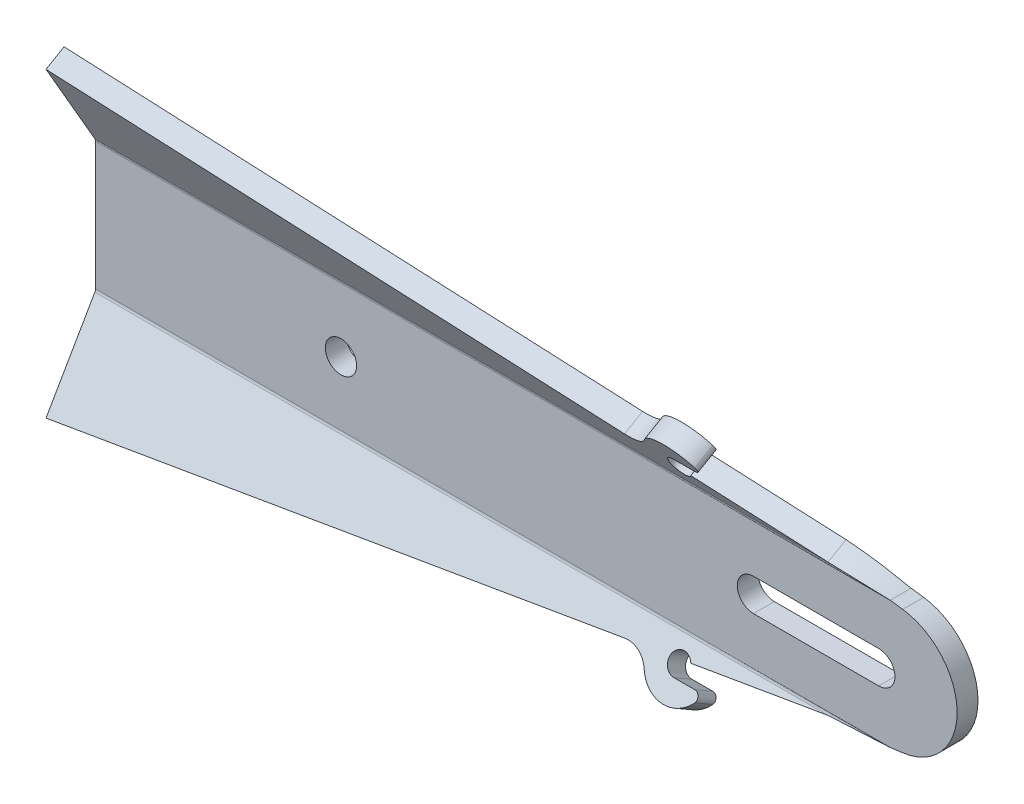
ISO-10303-21;
HEADER;
FILE_DESCRIPTION(('STEP AP214'),'2;1');
FILE_NAME('part.step','',(''),(''),'','','');
FILE_SCHEMA(('AUTOMOTIVE_DESIGN { 1 0 10303 214 1 1 1 1 }'));
ENDSEC;
DATA;
#1=APPLICATION_CONTEXT('core data for automotive mechanical design processes');
#2=APPLICATION_PROTOCOL_DEFINITION('international standard','automotive_design',2000,#1);
#3=PRODUCT_CONTEXT('',#1,'mechanical');
#4=PRODUCT('Part','Part','',(#3));
#5=PRODUCT_RELATED_PRODUCT_CATEGORY('part','',(#4));
#6=PRODUCT_DEFINITION_FORMATION('','',#4);
#7=PRODUCT_DEFINITION_CONTEXT('part definition',#1,'design');
#8=PRODUCT_DEFINITION('design','',#6,#7);
#9=PRODUCT_DEFINITION_SHAPE('','',#8);
#10=(LENGTH_UNIT() NAMED_UNIT(*) SI_UNIT(.MILLI.,.METRE.));
#11=(NAMED_UNIT(*) PLANE_ANGLE_UNIT() SI_UNIT($,.RADIAN.));
#12=(NAMED_UNIT(*) SI_UNIT($,.STERADIAN.) SOLID_ANGLE_UNIT());
#13=UNCERTAINTY_MEASURE_WITH_UNIT(LENGTH_MEASURE(1.E-05),#10,'distance_accuracy_value','');
#14=(GEOMETRIC_REPRESENTATION_CONTEXT(3) GLOBAL_UNCERTAINTY_ASSIGNED_CONTEXT((#13)) GLOBAL_UNIT_ASSIGNED_CONTEXT((#10,
#11,#12)) REPRESENTATION_CONTEXT('',''));
#15=CARTESIAN_POINT('',(0.,0.,0.));
#16=DIRECTION('',(0.,0.,1.));
#17=DIRECTION('',(1.,0.,0.));
#18=AXIS2_PLACEMENT_3D('',#15,#16,#17);
#19=CARTESIAN_POINT('',(-45.4619174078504,-21.222958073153,9.04627635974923));
#20=DIRECTION('',(0.,-0.500000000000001,-0.866025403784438));
#21=DIRECTION('',(-1.,0.,0.));
#22=AXIS2_PLACEMENT_3D('',#19,#20,#21);
#23=CYLINDRICAL_SURFACE('',#22,5.);
#24=CARTESIAN_POINT('',(-45.4619174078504,-23.222958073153,5.58217474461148));
#25=DIRECTION('',(0.,-0.500000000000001,-0.866025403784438));
#26=DIRECTION('',(-1.,0.,0.));
#27=AXIS2_PLACEMENT_3D('',#24,#25,#26);
#28=CIRCLE('',#27,5.);
#29=CARTESIAN_POINT('',(-46.1225408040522,-18.9307928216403,3.10409198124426));
#30=VERTEX_POINT('',#29);
#31=CARTESIAN_POINT('',(-41.1610458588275,-21.0145926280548,4.30717436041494));
#32=VERTEX_POINT('',#31);
#33=EDGE_CURVE('E100',#30,#32,#28,.T.);
#34=ORIENTED_EDGE('',*,*,#33,.T.);
#35=DIRECTION('',(0.,-0.500000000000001,-0.866025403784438));
#36=VECTOR('',#35,1.);
#37=CARTESIAN_POINT('',(-41.1610458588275,-19.0145926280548,7.77127597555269));
#38=LINE('',#37,#36);
#39=CARTESIAN_POINT('',(-41.1610458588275,-19.0145926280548,7.77127597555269));
#40=VERTEX_POINT('',#39);
#41=EDGE_CURVE('E401',#40,#32,#38,.T.);
#42=ORIENTED_EDGE('',*,*,#41,.F.);
#43=CARTESIAN_POINT('',(-45.4619174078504,-21.222958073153,9.04627635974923));
#44=DIRECTION('',(0.,-0.500000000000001,-0.866025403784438));
#45=DIRECTION('',(-1.,0.,0.));
#46=AXIS2_PLACEMENT_3D('',#43,#44,#45);
#47=CIRCLE('',#46,5.);
#48=CARTESIAN_POINT('',(-46.1225408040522,-16.9307928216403,6.56819359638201));
#49=VERTEX_POINT('',#48);
#50=EDGE_CURVE('E368',#49,#40,#47,.T.);
#51=ORIENTED_EDGE('',*,*,#50,.F.);
#52=DIRECTION('',(0.,-0.500000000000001,-0.866025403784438));
#53=VECTOR('',#52,1.);
#54=CARTESIAN_POINT('',(-46.1225408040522,-16.9307928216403,6.56819359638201));
#55=LINE('',#54,#53);
#56=EDGE_CURVE('E405',#49,#30,#55,.T.);
#57=ORIENTED_EDGE('',*,*,#56,.T.);
#58=EDGE_LOOP('',(#34,#42,#51,#57));
#59=FACE_BOUND('',#58,.T.);
#60=ADVANCED_FACE('F32',(#59),#23,.F.);
#61=CARTESIAN_POINT('',(-36.,-16.3645540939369,6.24127551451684));
#62=DIRECTION('',(0.,-0.500000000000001,-0.866025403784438));
#63=DIRECTION('',(-1.,0.,0.));
#64=AXIS2_PLACEMENT_3D('',#61,#62,#63);
#65=CYLINDRICAL_SURFACE('',#64,5.99999999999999);
#66=CARTESIAN_POINT('',(-36.,-18.3645540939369,2.77717389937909));
#67=DIRECTION('',(0.,0.500000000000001,0.866025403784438));
#68=DIRECTION('',(1.,0.,0.));
#69=AXIS2_PLACEMENT_3D('',#66,#67,#68);
#70=CIRCLE('',#69,5.99999999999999);
#71=CARTESIAN_POINT('',(-31.2,-21.4822455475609,4.5771738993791));
#72=VERTEX_POINT('',#71);
#73=EDGE_CURVE('E403',#32,#72,#70,.T.);
#74=ORIENTED_EDGE('',*,*,#73,.T.);
#75=DIRECTION('',(0.,-0.500000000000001,-0.866025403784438));
#76=VECTOR('',#75,1.);
#77=CARTESIAN_POINT('',(-31.2,-19.4822455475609,8.04127551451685));
#78=LINE('',#77,#76);
#79=CARTESIAN_POINT('',(-31.2,-19.4822455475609,8.04127551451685));
#80=VERTEX_POINT('',#79);
#81=EDGE_CURVE('E396',#80,#72,#78,.T.);
#82=ORIENTED_EDGE('',*,*,#81,.F.);
#83=CARTESIAN_POINT('',(-36.,-16.3645540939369,6.24127551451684));
#84=DIRECTION('',(0.,0.500000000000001,0.866025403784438));
#85=DIRECTION('',(1.,0.,0.));
#86=AXIS2_PLACEMENT_3D('',#83,#84,#85);
#87=CIRCLE('',#86,5.99999999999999);
#88=EDGE_CURVE('E366',#40,#80,#87,.T.);
#89=ORIENTED_EDGE('',*,*,#88,.F.);
#90=ORIENTED_EDGE('',*,*,#41,.T.);
#91=EDGE_LOOP('',(#74,#82,#89,#90));
#92=FACE_BOUND('',#91,.T.);
#93=ADVANCED_FACE('F455',(#92),#65,.T.);
#94=CARTESIAN_POINT('',(-32.,-18.9626303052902,7.74127551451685));
#95=DIRECTION('',(0.,-0.500000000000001,-0.866025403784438));
#96=DIRECTION('',(-1.,0.,0.));
#97=AXIS2_PLACEMENT_3D('',#94,#95,#96);
#98=CYLINDRICAL_SURFACE('',#97,0.999999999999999);
#99=CARTESIAN_POINT('',(-32.,-20.9626303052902,4.2771738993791));
#100=DIRECTION('',(0.,0.500000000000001,0.866025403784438));
#101=DIRECTION('',(1.,0.,0.));
#102=AXIS2_PLACEMENT_3D('',#99,#100,#101);
#103=CIRCLE('',#102,0.999999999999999);
#104=CARTESIAN_POINT('',(-32.,-20.0966049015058,3.77717389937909));
#105=VERTEX_POINT('',#104);
#106=EDGE_CURVE('E399',#72,#105,#103,.T.);
#107=ORIENTED_EDGE('',*,*,#106,.T.);
#108=DIRECTION('',(0.,-0.500000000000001,-0.866025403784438));
#109=VECTOR('',#108,1.);
#110=CARTESIAN_POINT('',(-32.,-18.0966049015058,7.24127551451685));
#111=LINE('',#110,#109);
#112=CARTESIAN_POINT('',(-32.,-18.0966049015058,7.24127551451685));
#113=VERTEX_POINT('',#112);
#114=EDGE_CURVE('E391',#113,#105,#111,.T.);
#115=ORIENTED_EDGE('',*,*,#114,.F.);
#116=CARTESIAN_POINT('',(-32.,-18.9626303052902,7.74127551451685));
#117=DIRECTION('',(0.,0.500000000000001,0.866025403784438));
#118=DIRECTION('',(1.,0.,0.));
#119=AXIS2_PLACEMENT_3D('',#116,#117,#118);
#120=CIRCLE('',#119,0.999999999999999);
#121=EDGE_CURVE('E364',#80,#113,#120,.T.);
#122=ORIENTED_EDGE('',*,*,#121,.F.);
#123=ORIENTED_EDGE('',*,*,#81,.T.);
#124=EDGE_LOOP('',(#107,#115,#122,#123));
#125=FACE_BOUND('',#124,.T.);
#126=ADVANCED_FACE('F451',(#125),#98,.T.);
#127=CARTESIAN_POINT('',(-32.,-18.0966049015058,7.24127551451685));
#128=DIRECTION('',(0.,-0.866025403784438,0.500000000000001));
#129=DIRECTION('',(1.,0.,0.));
#130=AXIS2_PLACEMENT_3D('',#127,#128,#129);
#131=PLANE('',#130);
#132=DIRECTION('',(-1.,0.,0.));
#133=VECTOR('',#132,1.);
#134=CARTESIAN_POINT('',(-32.,-20.0966049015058,3.77717389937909));
#135=LINE('',#134,#133);
#136=CARTESIAN_POINT('',(-36.,-20.0966049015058,3.77717389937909));
#137=VERTEX_POINT('',#136);
#138=EDGE_CURVE('E394',#105,#137,#135,.T.);
#139=ORIENTED_EDGE('',*,*,#138,.T.);
#140=DIRECTION('',(0.,-0.500000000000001,-0.866025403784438));
#141=VECTOR('',#140,1.);
#142=CARTESIAN_POINT('',(-36.,-18.0966049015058,7.24127551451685));
#143=LINE('',#142,#141);
#144=CARTESIAN_POINT('',(-36.,-18.0966049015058,7.24127551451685));
#145=VERTEX_POINT('',#144);
#146=EDGE_CURVE('E386',#145,#137,#143,.T.);
#147=ORIENTED_EDGE('',*,*,#146,.F.);
#148=DIRECTION('',(-1.,0.,0.));
#149=VECTOR('',#148,1.);
#150=CARTESIAN_POINT('',(-32.,-18.0966049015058,7.24127551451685));
#151=LINE('',#150,#149);
#152=EDGE_CURVE('E42',#113,#145,#151,.T.);
#153=ORIENTED_EDGE('',*,*,#152,.F.);
#154=ORIENTED_EDGE('',*,*,#114,.T.);
#155=EDGE_LOOP('',(#139,#147,#153,#154));
#156=FACE_BOUND('',#155,.T.);
#157=ADVANCED_FACE('F447',(#156),#131,.F.);
#158=CARTESIAN_POINT('',(-36.,-16.3645540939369,6.24127551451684));
#159=DIRECTION('',(0.,-0.500000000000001,-0.866025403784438));
#160=DIRECTION('',(-1.,0.,0.));
#161=AXIS2_PLACEMENT_3D('',#158,#159,#160);
#162=CYLINDRICAL_SURFACE('',#161,2.);
#163=CARTESIAN_POINT('',(-36.,-18.3645540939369,2.77717389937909));
#164=DIRECTION('',(0.,-0.500000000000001,-0.866025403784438));
#165=DIRECTION('',(-1.,0.,0.));
#166=AXIS2_PLACEMENT_3D('',#163,#164,#165);
#167=CIRCLE('',#166,2.);
#168=CARTESIAN_POINT('',(-34.2300871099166,-17.5579834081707,2.3115000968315));
#169=VERTEX_POINT('',#168);
#170=EDGE_CURVE('E389',#137,#169,#167,.T.);
#171=ORIENTED_EDGE('',*,*,#170,.T.);
#172=DIRECTION('',(0.,-0.500000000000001,-0.866025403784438));
#173=VECTOR('',#172,1.);
#174=CARTESIAN_POINT('',(-34.2300871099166,-15.5579834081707,5.77560171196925));
#175=LINE('',#174,#173);
#176=CARTESIAN_POINT('',(-34.2300871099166,-15.5579834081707,5.77560171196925));
#177=VERTEX_POINT('',#176);
#178=EDGE_CURVE('E375',#177,#169,#175,.T.);
#179=ORIENTED_EDGE('',*,*,#178,.F.);
#180=CARTESIAN_POINT('',(-36.,-16.3645540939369,6.24127551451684));
#181=DIRECTION('',(0.,-0.500000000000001,-0.866025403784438));
#182=DIRECTION('',(-1.,0.,0.));
#183=AXIS2_PLACEMENT_3D('',#180,#181,#182);
#184=CIRCLE('',#183,2.);
#185=EDGE_CURVE('E11',#145,#177,#184,.T.);
#186=ORIENTED_EDGE('',*,*,#185,.F.);
#187=ORIENTED_EDGE('',*,*,#146,.T.);
#188=EDGE_LOOP('',(#171,#179,#186,#187));
#189=FACE_BOUND('',#188,.T.);
#190=ADVANCED_FACE('F443',(#189),#162,.F.);
#191=CARTESIAN_POINT('',(-46.1225408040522,-16.9307928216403,6.56819359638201));
#192=DIRECTION('',(-0.132124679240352,0.858433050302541,-0.495616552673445));
#193=DIRECTION('',(-0.991233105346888,-0.114423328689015,0.066062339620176));
#194=AXIS2_PLACEMENT_3D('',#191,#192,#193);
#195=PLANE('',#194);
#196=DIRECTION('',(0.991233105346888,0.114423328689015,-0.066062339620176));
#197=VECTOR('',#196,1.);
#198=CARTESIAN_POINT('',(-46.1225408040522,-18.9307928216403,3.10409198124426));
#199=LINE('',#198,#197);
#200=CARTESIAN_POINT('',(-150.,-30.9219224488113,10.0271738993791));
#201=VERTEX_POINT('',#200);
#202=EDGE_CURVE('E384',#201,#30,#199,.T.);
#203=ORIENTED_EDGE('',*,*,#202,.T.);
#204=ORIENTED_EDGE('',*,*,#56,.F.);
#205=DIRECTION('',(0.991233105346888,0.114423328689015,-0.066062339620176));
#206=VECTOR('',#205,1.);
#207=CARTESIAN_POINT('',(-46.1225408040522,-16.9307928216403,6.56819359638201));
#208=LINE('',#207,#206);
#209=CARTESIAN_POINT('',(-150.,-28.9219224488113,13.4912755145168));
#210=VERTEX_POINT('',#209);
#211=EDGE_CURVE('E370',#210,#49,#208,.T.);
#212=ORIENTED_EDGE('',*,*,#211,.F.);
#213=DIRECTION('',(0.,-0.500000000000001,-0.866025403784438));
#214=VECTOR('',#213,1.);
#215=CARTESIAN_POINT('',(-150.,-28.9219224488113,13.4912755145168));
#216=LINE('',#215,#214);
#217=EDGE_CURVE('E381',#210,#201,#216,.T.);
#218=ORIENTED_EDGE('',*,*,#217,.T.);
#219=EDGE_LOOP('',(#203,#204,#212,#218));
#220=FACE_BOUND('',#219,.T.);
#221=ADVANCED_FACE('F439',(#220),#195,.F.);
#222=CARTESIAN_POINT('',(-150.,-28.9219224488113,13.4912755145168));
#223=DIRECTION('',(1.,0.,0.));
#224=DIRECTION('',(0.,-0.500000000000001,-0.866025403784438));
#225=AXIS2_PLACEMENT_3D('',#222,#223,#224);
#226=PLANE('',#225);
#227=DIRECTION('',(0.,0.499999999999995,0.866025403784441));
#228=VECTOR('',#227,1.);
#229=CARTESIAN_POINT('',(-150.,-12.7146018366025,4.13397459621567));
#230=LINE('',#229,#228);
#231=CARTESIAN_POINT('',(-150.,-14.7146018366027,0.669872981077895));
#232=VERTEX_POINT('',#231);
#233=CARTESIAN_POINT('',(-150.,-12.7146018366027,4.13397459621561));
#234=VERTEX_POINT('',#233);
#235=EDGE_CURVE('E408',#232,#234,#230,.T.);
#236=ORIENTED_EDGE('',*,*,#235,.F.);
#237=DIRECTION('',(0.,-0.866025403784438,0.500000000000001));
#238=VECTOR('',#237,1.);
#239=CARTESIAN_POINT('',(-150.,-30.9219224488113,10.0271738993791));
#240=LINE('',#239,#238);
#241=EDGE_CURVE('E379',#232,#201,#240,.T.);
#242=ORIENTED_EDGE('',*,*,#241,.T.);
#243=ORIENTED_EDGE('',*,*,#217,.F.);
#244=DIRECTION('',(0.,-0.866025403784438,0.500000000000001));
#245=VECTOR('',#244,1.);
#246=CARTESIAN_POINT('',(-150.,-28.9219224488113,13.4912755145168));
#247=LINE('',#246,#245);
#248=EDGE_CURVE('E372',#234,#210,#247,.T.);
#249=ORIENTED_EDGE('',*,*,#248,.F.);
#250=EDGE_LOOP('',(#236,#242,#243,#249));
#251=FACE_BOUND('',#250,.T.);
#252=ADVANCED_FACE('F436',(#251),#226,.F.);
#253=CARTESIAN_POINT('',(-45.4619174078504,17.670764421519,-18.0278269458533));
#254=DIRECTION('',(0.,0.500000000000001,0.866025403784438));
#255=DIRECTION('',(1.,0.,0.));
#256=AXIS2_PLACEMENT_3D('',#253,#254,#255);
#257=PLANE('',#256);
#258=DIRECTION('',(-1.,0.,0.));
#259=VECTOR('',#258,1.);
#260=CARTESIAN_POINT('',(-45.4619174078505,-14.7146018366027,0.669872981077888));
#261=LINE('',#260,#259);
#262=CARTESIAN_POINT('',(-9.59827489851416,-14.7146018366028,0.669872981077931));
#263=VERTEX_POINT('',#262);
#264=EDGE_CURVE('E108',#263,#232,#261,.T.);
#265=ORIENTED_EDGE('',*,*,#264,.F.);
#266=DIRECTION('',(0.991233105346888,0.114423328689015,-0.0660623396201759));
#267=VECTOR('',#266,1.);
#268=CARTESIAN_POINT('',(4.58549615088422,-13.0772934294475,-0.27542746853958));
#269=LINE('',#268,#267);
#270=EDGE_CURVE('E378',#169,#263,#269,.T.);
#271=ORIENTED_EDGE('',*,*,#270,.F.);
#272=ORIENTED_EDGE('',*,*,#170,.F.);
#273=ORIENTED_EDGE('',*,*,#138,.F.);
#274=ORIENTED_EDGE('',*,*,#106,.F.);
#275=ORIENTED_EDGE('',*,*,#73,.F.);
#276=ORIENTED_EDGE('',*,*,#33,.F.);
#277=ORIENTED_EDGE('',*,*,#202,.F.);
#278=ORIENTED_EDGE('',*,*,#241,.F.);
#279=EDGE_LOOP('',(#265,#271,#272,#273,#274,#275,#276,#277,#278));
#280=FACE_BOUND('',#279,.T.);
#281=ADVANCED_FACE('F433',(#280),#257,.F.);
#282=CARTESIAN_POINT('',(4.58549615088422,-11.0772934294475,3.18867414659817));
#283=DIRECTION('',(-0.132124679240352,0.858433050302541,-0.495616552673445));
#284=DIRECTION('',(-0.991233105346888,-0.114423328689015,0.0660623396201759));
#285=AXIS2_PLACEMENT_3D('',#282,#283,#284);
#286=PLANE('',#285);
#287=CARTESIAN_POINT('',(-9.59827489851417,-12.7146018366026,4.1339745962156));
#288=CARTESIAN_POINT('',(-9.59827489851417,-14.7146018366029,0.669872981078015));
#289=B_SPLINE_CURVE_WITH_KNOTS('',1,(#287,#288),.UNSPECIFIED.,.F.,.F.,(2,2),(0.,1.),.UNSPECIFIED.);
#290=CARTESIAN_POINT('',(-9.59827489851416,-12.7146018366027,4.13397459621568));
#291=VERTEX_POINT('',#290);
#292=EDGE_CURVE('E273',#291,#263,#289,.T.);
#293=ORIENTED_EDGE('',*,*,#292,.F.);
#294=DIRECTION('',(0.991233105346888,0.114423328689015,-0.0660623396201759));
#295=VECTOR('',#294,1.);
#296=CARTESIAN_POINT('',(4.58549615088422,-11.0772934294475,3.18867414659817));
#297=LINE('',#296,#295);
#298=EDGE_CURVE('E414',#177,#291,#297,.T.);
#299=ORIENTED_EDGE('',*,*,#298,.F.);
#300=ORIENTED_EDGE('',*,*,#178,.T.);
#301=ORIENTED_EDGE('',*,*,#270,.T.);
#302=EDGE_LOOP('',(#293,#299,#300,#301));
#303=FACE_BOUND('',#302,.T.);
#304=ADVANCED_FACE('F424',(#303),#286,.F.);
#305=CARTESIAN_POINT('',(-45.4619174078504,19.670764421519,-14.5637253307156));
#306=DIRECTION('',(0.,0.500000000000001,0.866025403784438));
#307=DIRECTION('',(1.,0.,0.));
#308=AXIS2_PLACEMENT_3D('',#305,#306,#307);
#309=PLANE('',#308);
#310=ORIENTED_EDGE('',*,*,#298,.T.);
#311=DIRECTION('',(-1.,0.,0.));
#312=VECTOR('',#311,1.);
#313=CARTESIAN_POINT('',(-45.4619174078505,-12.7146018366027,4.13397459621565));
#314=LINE('',#313,#312);
#315=EDGE_CURVE('E374',#291,#234,#314,.T.);
#316=ORIENTED_EDGE('',*,*,#315,.T.);
#317=ORIENTED_EDGE('',*,*,#248,.T.);
#318=ORIENTED_EDGE('',*,*,#211,.T.);
#319=ORIENTED_EDGE('',*,*,#50,.T.);
#320=ORIENTED_EDGE('',*,*,#88,.T.);
#321=ORIENTED_EDGE('',*,*,#121,.T.);
#322=ORIENTED_EDGE('',*,*,#152,.T.);
#323=ORIENTED_EDGE('',*,*,#185,.T.);
#324=EDGE_LOOP('',(#310,#316,#317,#318,#319,#320,#321,#322,#323));
#325=FACE_BOUND('',#324,.T.);
#326=ADVANCED_FACE('F34',(#325),#309,.T.);
#327=CARTESIAN_POINT('',(-32.,18.0966049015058,7.24127551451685));
#328=DIRECTION('',(0.,0.866025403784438,0.500000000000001));
#329=DIRECTION('',(-1.,0.,0.));
#330=AXIS2_PLACEMENT_3D('',#327,#328,#329);
#331=PLANE('',#330);
#332=DIRECTION('',(1.,0.,0.));
#333=VECTOR('',#332,1.);
#334=CARTESIAN_POINT('',(-32.,20.0966049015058,3.7771738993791));
#335=LINE('',#334,#333);
#336=CARTESIAN_POINT('',(-36.,20.0966049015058,3.7771738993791));
#337=VERTEX_POINT('',#336);
#338=CARTESIAN_POINT('',(-32.,20.0966049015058,3.7771738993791));
#339=VERTEX_POINT('',#338);
#340=EDGE_CURVE('E970',#337,#339,#335,.T.);
#341=ORIENTED_EDGE('',*,*,#340,.T.);
#342=DIRECTION('',(0.,0.500000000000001,-0.866025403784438));
#343=VECTOR('',#342,1.);
#344=CARTESIAN_POINT('',(-32.,18.0966049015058,7.24127551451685));
#345=LINE('',#344,#343);
#346=CARTESIAN_POINT('',(-32.,18.0966049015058,7.24127551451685));
#347=VERTEX_POINT('',#346);
#348=EDGE_CURVE('E962',#347,#339,#345,.T.);
#349=ORIENTED_EDGE('',*,*,#348,.F.);
#350=DIRECTION('',(1.,0.,0.));
#351=VECTOR('',#350,1.);
#352=CARTESIAN_POINT('',(-32.,18.0966049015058,7.24127551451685));
#353=LINE('',#352,#351);
#354=CARTESIAN_POINT('',(-36.,18.0966049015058,7.24127551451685));
#355=VERTEX_POINT('',#354);
#356=EDGE_CURVE('E929',#355,#347,#353,.T.);
#357=ORIENTED_EDGE('',*,*,#356,.F.);
#358=DIRECTION('',(0.,0.500000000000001,-0.866025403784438));
#359=VECTOR('',#358,1.);
#360=CARTESIAN_POINT('',(-36.,18.0966049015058,7.24127551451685));
#361=LINE('',#360,#359);
#362=EDGE_CURVE('E967',#355,#337,#361,.T.);
#363=ORIENTED_EDGE('',*,*,#362,.T.);
#364=EDGE_LOOP('',(#341,#349,#357,#363));
#365=FACE_BOUND('',#364,.T.);
#366=ADVANCED_FACE('F500',(#365),#331,.F.);
#367=CARTESIAN_POINT('',(-32.,18.9626303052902,7.74127551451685));
#368=DIRECTION('',(0.,0.500000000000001,-0.866025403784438));
#369=DIRECTION('',(-1.,0.,0.));
#370=AXIS2_PLACEMENT_3D('',#367,#368,#369);
#371=CYLINDRICAL_SURFACE('',#370,0.999999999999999);
#372=CARTESIAN_POINT('',(-32.,20.9626303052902,4.2771738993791));
#373=DIRECTION('',(0.,-0.500000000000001,0.866025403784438));
#374=DIRECTION('',(-1.,0.,0.));
#375=AXIS2_PLACEMENT_3D('',#372,#373,#374);
#376=CIRCLE('',#375,0.999999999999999);
#377=CARTESIAN_POINT('',(-31.2,21.4822455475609,4.5771738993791));
#378=VERTEX_POINT('',#377);
#379=EDGE_CURVE('E965',#339,#378,#376,.T.);
#380=ORIENTED_EDGE('',*,*,#379,.T.);
#381=DIRECTION('',(0.,0.500000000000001,-0.866025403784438));
#382=VECTOR('',#381,1.);
#383=CARTESIAN_POINT('',(-31.2,19.4822455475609,8.04127551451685));
#384=LINE('',#383,#382);
#385=CARTESIAN_POINT('',(-31.2,19.4822455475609,8.04127551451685));
#386=VERTEX_POINT('',#385);
#387=EDGE_CURVE('E957',#386,#378,#384,.T.);
#388=ORIENTED_EDGE('',*,*,#387,.F.);
#389=CARTESIAN_POINT('',(-32.,18.9626303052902,7.74127551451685));
#390=DIRECTION('',(0.,-0.500000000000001,0.866025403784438));
#391=DIRECTION('',(-1.,0.,0.));
#392=AXIS2_PLACEMENT_3D('',#389,#390,#391);
#393=CIRCLE('',#392,0.999999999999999);
#394=EDGE_CURVE('E927',#347,#386,#393,.T.);
#395=ORIENTED_EDGE('',*,*,#394,.F.);
#396=ORIENTED_EDGE('',*,*,#348,.T.);
#397=EDGE_LOOP('',(#380,#388,#395,#396));
#398=FACE_BOUND('',#397,.T.);
#399=ADVANCED_FACE('F506',(#398),#371,.T.);
#400=CARTESIAN_POINT('',(-36.,16.3645540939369,6.24127551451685));
#401=DIRECTION('',(0.,0.500000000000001,-0.866025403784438));
#402=DIRECTION('',(-1.,0.,0.));
#403=AXIS2_PLACEMENT_3D('',#400,#401,#402);
#404=CYLINDRICAL_SURFACE('',#403,5.99999999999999);
#405=CARTESIAN_POINT('',(-36.,18.3645540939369,2.7771738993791));
#406=DIRECTION('',(0.,-0.500000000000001,0.866025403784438));
#407=DIRECTION('',(-1.,0.,0.));
#408=AXIS2_PLACEMENT_3D('',#405,#406,#407);
#409=CIRCLE('',#408,5.99999999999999);
#410=CARTESIAN_POINT('',(-41.1610458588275,21.0145926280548,4.30717436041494));
#411=VERTEX_POINT('',#410);
#412=EDGE_CURVE('E960',#378,#411,#409,.T.);
#413=ORIENTED_EDGE('',*,*,#412,.T.);
#414=DIRECTION('',(0.,0.500000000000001,-0.866025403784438));
#415=VECTOR('',#414,1.);
#416=CARTESIAN_POINT('',(-41.1610458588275,19.0145926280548,7.7712759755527));
#417=LINE('',#416,#415);
#418=CARTESIAN_POINT('',(-41.1610458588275,19.0145926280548,7.7712759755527));
#419=VERTEX_POINT('',#418);
#420=EDGE_CURVE('E952',#419,#411,#417,.T.);
#421=ORIENTED_EDGE('',*,*,#420,.F.);
#422=CARTESIAN_POINT('',(-36.,16.3645540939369,6.24127551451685));
#423=DIRECTION('',(0.,-0.500000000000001,0.866025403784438));
#424=DIRECTION('',(-1.,0.,0.));
#425=AXIS2_PLACEMENT_3D('',#422,#423,#424);
#426=CIRCLE('',#425,5.99999999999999);
#427=EDGE_CURVE('E925',#386,#419,#426,.T.);
#428=ORIENTED_EDGE('',*,*,#427,.F.);
#429=ORIENTED_EDGE('',*,*,#387,.T.);
#430=EDGE_LOOP('',(#413,#421,#428,#429));
#431=FACE_BOUND('',#430,.T.);
#432=ADVANCED_FACE('F514',(#431),#404,.T.);
#433=CARTESIAN_POINT('',(-45.4619174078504,21.222958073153,9.04627635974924));
#434=DIRECTION('',(0.,0.500000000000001,-0.866025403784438));
#435=DIRECTION('',(-1.,0.,0.));
#436=AXIS2_PLACEMENT_3D('',#433,#434,#435);
#437=CYLINDRICAL_SURFACE('',#436,5.);
#438=CARTESIAN_POINT('',(-45.4619174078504,23.222958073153,5.58217474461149));
#439=DIRECTION('',(0.,0.500000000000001,-0.866025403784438));
#440=DIRECTION('',(1.,0.,0.));
#441=AXIS2_PLACEMENT_3D('',#438,#439,#440);
#442=CIRCLE('',#441,5.);
#443=CARTESIAN_POINT('',(-46.1225408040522,18.9307928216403,3.10409198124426));
#444=VERTEX_POINT('',#443);
#445=EDGE_CURVE('E955',#411,#444,#442,.T.);
#446=ORIENTED_EDGE('',*,*,#445,.T.);
#447=DIRECTION('',(0.,0.500000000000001,-0.866025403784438));
#448=VECTOR('',#447,1.);
#449=CARTESIAN_POINT('',(-46.1225408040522,16.9307928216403,6.56819359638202));
#450=LINE('',#449,#448);
#451=CARTESIAN_POINT('',(-46.1225408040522,16.9307928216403,6.56819359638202));
#452=VERTEX_POINT('',#451);
#453=EDGE_CURVE('E947',#452,#444,#450,.T.);
#454=ORIENTED_EDGE('',*,*,#453,.F.);
#455=CARTESIAN_POINT('',(-45.4619174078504,21.222958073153,9.04627635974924));
#456=DIRECTION('',(0.,0.500000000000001,-0.866025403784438));
#457=DIRECTION('',(1.,0.,0.));
#458=AXIS2_PLACEMENT_3D('',#455,#456,#457);
#459=CIRCLE('',#458,5.);
#460=EDGE_CURVE('E923',#419,#452,#459,.T.);
#461=ORIENTED_EDGE('',*,*,#460,.F.);
#462=ORIENTED_EDGE('',*,*,#420,.T.);
#463=EDGE_LOOP('',(#446,#454,#461,#462));
#464=FACE_BOUND('',#463,.T.);
#465=ADVANCED_FACE('F522',(#464),#437,.F.);
#466=CARTESIAN_POINT('',(-150.,28.9219224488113,13.4912755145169));
#467=DIRECTION('',(-0.132124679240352,-0.858433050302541,-0.495616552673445));
#468=DIRECTION('',(0.991233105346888,-0.114423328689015,-0.0660623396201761));
#469=AXIS2_PLACEMENT_3D('',#466,#467,#468);
#470=PLANE('',#469);
#471=DIRECTION('',(-0.991233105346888,0.114423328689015,0.0660623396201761));
#472=VECTOR('',#471,1.);
#473=CARTESIAN_POINT('',(-150.,30.9219224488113,10.0271738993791));
#474=LINE('',#473,#472);
#475=CARTESIAN_POINT('',(-150.,30.9219224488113,10.0271738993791));
#476=VERTEX_POINT('',#475);
#477=EDGE_CURVE('E950',#444,#476,#474,.T.);
#478=ORIENTED_EDGE('',*,*,#477,.T.);
#479=DIRECTION('',(0.,0.500000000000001,-0.866025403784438));
#480=VECTOR('',#479,1.);
#481=CARTESIAN_POINT('',(-150.,28.9219224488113,13.4912755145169));
#482=LINE('',#481,#480);
#483=CARTESIAN_POINT('',(-150.,28.9219224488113,13.4912755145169));
#484=VERTEX_POINT('',#483);
#485=EDGE_CURVE('E938',#484,#476,#482,.T.);
#486=ORIENTED_EDGE('',*,*,#485,.F.);
#487=DIRECTION('',(-0.991233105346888,0.114423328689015,0.0660623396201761));
#488=VECTOR('',#487,1.);
#489=CARTESIAN_POINT('',(-150.,28.9219224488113,13.4912755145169));
#490=LINE('',#489,#488);
#491=EDGE_CURVE('E117',#452,#484,#490,.T.);
#492=ORIENTED_EDGE('',*,*,#491,.F.);
#493=ORIENTED_EDGE('',*,*,#453,.T.);
#494=EDGE_LOOP('',(#478,#486,#492,#493));
#495=FACE_BOUND('',#494,.T.);
#496=ADVANCED_FACE('F530',(#495),#470,.F.);
#497=CARTESIAN_POINT('',(-36.,16.3645540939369,6.24127551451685));
#498=DIRECTION('',(0.,0.500000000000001,-0.866025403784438));
#499=DIRECTION('',(-1.,0.,0.));
#500=AXIS2_PLACEMENT_3D('',#497,#498,#499);
#501=CYLINDRICAL_SURFACE('',#500,2.);
#502=CARTESIAN_POINT('',(-36.,18.3645540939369,2.7771738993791));
#503=DIRECTION('',(0.,0.500000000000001,-0.866025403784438));
#504=DIRECTION('',(1.,0.,0.));
#505=AXIS2_PLACEMENT_3D('',#502,#503,#504);
#506=CIRCLE('',#505,2.);
#507=CARTESIAN_POINT('',(-34.2300871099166,17.5579834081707,2.3115000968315));
#508=VERTEX_POINT('',#507);
#509=EDGE_CURVE('E945',#508,#337,#506,.T.);
#510=ORIENTED_EDGE('',*,*,#509,.T.);
#511=ORIENTED_EDGE('',*,*,#362,.F.);
#512=CARTESIAN_POINT('',(-36.,16.3645540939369,6.24127551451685));
#513=DIRECTION('',(0.,0.500000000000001,-0.866025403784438));
#514=DIRECTION('',(1.,0.,0.));
#515=AXIS2_PLACEMENT_3D('',#512,#513,#514);
#516=CIRCLE('',#515,2.);
#517=CARTESIAN_POINT('',(-34.2300871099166,15.5579834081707,5.77560171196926));
#518=VERTEX_POINT('',#517);
#519=EDGE_CURVE('E931',#518,#355,#516,.T.);
#520=ORIENTED_EDGE('',*,*,#519,.F.);
#521=DIRECTION('',(0.,0.500000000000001,-0.866025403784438));
#522=VECTOR('',#521,1.);
#523=CARTESIAN_POINT('',(-34.2300871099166,15.5579834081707,5.77560171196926));
#524=LINE('',#523,#522);
#525=EDGE_CURVE('E942',#518,#508,#524,.T.);
#526=ORIENTED_EDGE('',*,*,#525,.T.);
#527=EDGE_LOOP('',(#510,#511,#520,#526));
#528=FACE_BOUND('',#527,.T.);
#529=ADVANCED_FACE('F322',(#528),#501,.F.);
#530=CARTESIAN_POINT('',(-34.2300871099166,15.5579834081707,5.77560171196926));
#531=DIRECTION('',(-0.132124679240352,-0.858433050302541,-0.495616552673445));
#532=DIRECTION('',(0.991233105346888,-0.114423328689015,-0.066062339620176));
#533=AXIS2_PLACEMENT_3D('',#530,#531,#532);
#534=PLANE('',#533);
#535=CARTESIAN_POINT('',(-9.59827489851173,14.7146018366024,0.669872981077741));
#536=CARTESIAN_POINT('',(-9.59827489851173,12.7146018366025,4.13397459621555));
#537=B_SPLINE_CURVE_WITH_KNOTS('',1,(#535,#536),.UNSPECIFIED.,.F.,.F.,(2,2),(0.,1.),.UNSPECIFIED.);
#538=CARTESIAN_POINT('',(-9.59827489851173,14.7146018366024,0.669872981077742));
#539=VERTEX_POINT('',#538);
#540=CARTESIAN_POINT('',(-9.5982748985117,12.7146018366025,4.13397459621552));
#541=VERTEX_POINT('',#540);
#542=EDGE_CURVE('E356',#539,#541,#537,.T.);
#543=ORIENTED_EDGE('',*,*,#542,.F.);
#544=DIRECTION('',(-0.991233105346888,0.114423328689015,0.0660623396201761));
#545=VECTOR('',#544,1.);
#546=CARTESIAN_POINT('',(-34.2300871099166,17.5579834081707,2.3115000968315));
#547=LINE('',#546,#545);
#548=EDGE_CURVE('E941',#539,#508,#547,.T.);
#549=ORIENTED_EDGE('',*,*,#548,.T.);
#550=ORIENTED_EDGE('',*,*,#525,.F.);
#551=DIRECTION('',(-0.991233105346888,0.114423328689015,0.0660623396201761));
#552=VECTOR('',#551,1.);
#553=CARTESIAN_POINT('',(-34.2300871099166,15.5579834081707,5.77560171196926));
#554=LINE('',#553,#552);
#555=EDGE_CURVE('E933',#541,#518,#554,.T.);
#556=ORIENTED_EDGE('',*,*,#555,.F.);
#557=EDGE_LOOP('',(#543,#549,#550,#556));
#558=FACE_BOUND('',#557,.T.);
#559=ADVANCED_FACE('F311',(#558),#534,.F.);
#560=CARTESIAN_POINT('',(-45.4619174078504,23.222958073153,5.58217474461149));
#561=DIRECTION('',(0.,-0.500000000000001,0.866025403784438));
#562=DIRECTION('',(1.,0.,0.));
#563=AXIS2_PLACEMENT_3D('',#560,#561,#562);
#564=PLANE('',#563);
#565=DIRECTION('',(1.,0.,0.));
#566=VECTOR('',#565,1.);
#567=CARTESIAN_POINT('',(-45.4619174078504,14.7146018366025,0.669872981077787));
#568=LINE('',#567,#566);
#569=CARTESIAN_POINT('',(-150.,14.7146018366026,0.669872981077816));
#570=VERTEX_POINT('',#569);
#571=EDGE_CURVE('E168',#570,#539,#568,.T.);
#572=ORIENTED_EDGE('',*,*,#571,.F.);
#573=DIRECTION('',(0.,-0.866025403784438,-0.500000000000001));
#574=VECTOR('',#573,1.);
#575=CARTESIAN_POINT('',(-150.,-25.3697287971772,-22.472826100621));
#576=LINE('',#575,#574);
#577=EDGE_CURVE('E936',#476,#570,#576,.T.);
#578=ORIENTED_EDGE('',*,*,#577,.F.);
#579=ORIENTED_EDGE('',*,*,#477,.F.);
#580=ORIENTED_EDGE('',*,*,#445,.F.);
#581=ORIENTED_EDGE('',*,*,#412,.F.);
#582=ORIENTED_EDGE('',*,*,#379,.F.);
#583=ORIENTED_EDGE('',*,*,#340,.F.);
#584=ORIENTED_EDGE('',*,*,#509,.F.);
#585=ORIENTED_EDGE('',*,*,#548,.F.);
#586=EDGE_LOOP('',(#572,#578,#579,#580,#581,#582,#583,#584,#585));
#587=FACE_BOUND('',#586,.T.);
#588=ADVANCED_FACE('F321',(#587),#564,.F.);
#589=CARTESIAN_POINT('',(-150.,-27.3697287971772,-19.0087244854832));
#590=DIRECTION('',(1.,0.,0.));
#591=DIRECTION('',(0.,0.500000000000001,-0.866025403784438));
#592=AXIS2_PLACEMENT_3D('',#589,#590,#591);
#593=PLANE('',#592);
#594=DIRECTION('',(0.,0.500000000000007,-0.866025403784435));
#595=VECTOR('',#594,1.);
#596=CARTESIAN_POINT('',(-150.,12.7146018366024,4.13397459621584));
#597=LINE('',#596,#595);
#598=CARTESIAN_POINT('',(-150.,12.7146018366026,4.13397459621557));
#599=VERTEX_POINT('',#598);
#600=EDGE_CURVE('E972',#599,#570,#597,.T.);
#601=ORIENTED_EDGE('',*,*,#600,.F.);
#602=DIRECTION('',(0.,-0.866025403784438,-0.500000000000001));
#603=VECTOR('',#602,1.);
#604=CARTESIAN_POINT('',(-150.,-27.3697287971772,-19.0087244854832));
#605=LINE('',#604,#603);
#606=EDGE_CURVE('E934',#484,#599,#605,.T.);
#607=ORIENTED_EDGE('',*,*,#606,.F.);
#608=ORIENTED_EDGE('',*,*,#485,.T.);
#609=ORIENTED_EDGE('',*,*,#577,.T.);
#610=EDGE_LOOP('',(#601,#607,#608,#609));
#611=FACE_BOUND('',#610,.T.);
#612=ADVANCED_FACE('F327',(#611),#593,.F.);
#613=CARTESIAN_POINT('',(-45.4619174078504,21.222958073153,9.04627635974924));
#614=DIRECTION('',(0.,-0.500000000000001,0.866025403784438));
#615=DIRECTION('',(1.,0.,0.));
#616=AXIS2_PLACEMENT_3D('',#613,#614,#615);
#617=PLANE('',#616);
#618=ORIENTED_EDGE('',*,*,#606,.T.);
#619=DIRECTION('',(1.,0.,0.));
#620=VECTOR('',#619,1.);
#621=CARTESIAN_POINT('',(-45.4619174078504,12.7146018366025,4.13397459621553));
#622=LINE('',#621,#620);
#623=EDGE_CURVE('E172',#599,#541,#622,.T.);
#624=ORIENTED_EDGE('',*,*,#623,.T.);
#625=ORIENTED_EDGE('',*,*,#555,.T.);
#626=ORIENTED_EDGE('',*,*,#519,.T.);
#627=ORIENTED_EDGE('',*,*,#356,.T.);
#628=ORIENTED_EDGE('',*,*,#394,.T.);
#629=ORIENTED_EDGE('',*,*,#427,.T.);
#630=ORIENTED_EDGE('',*,*,#460,.T.);
#631=ORIENTED_EDGE('',*,*,#491,.T.);
#632=EDGE_LOOP('',(#618,#624,#625,#626,#627,#628,#629,#630,#631));
#633=FACE_BOUND('',#632,.T.);
#634=ADVANCED_FACE('F330',(#633),#617,.T.);
#635=CARTESIAN_POINT('',(-45.4619174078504,23.6100016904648,0.));
#636=DIRECTION('',(0.,0.,1.));
#637=DIRECTION('',(1.,0.,0.));
#638=AXIS2_PLACEMENT_3D('',#635,#636,#637);
#639=PLANE('',#638);
#640=CARTESIAN_POINT('',(-103.,0.,0.));
#641=DIRECTION('',(0.,0.,1.));
#642=DIRECTION('',(1.,0.,0.));
#643=AXIS2_PLACEMENT_3D('',#640,#641,#642);
#644=CIRCLE('',#643,3.00000000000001);
#645=CARTESIAN_POINT('',(-100.,0.,0.));
#646=VERTEX_POINT('',#645);
#647=EDGE_CURVE('E903',#646,#646,#644,.T.);
#648=ORIENTED_EDGE('',*,*,#647,.T.);
#649=EDGE_LOOP('',(#648));
#650=FACE_BOUND('',#649,.T.);
#651=CARTESIAN_POINT('',(0.,0.,0.));
#652=DIRECTION('',(0.,0.,1.));
#653=DIRECTION('',(1.,0.,0.));
#654=AXIS2_PLACEMENT_3D('',#651,#652,#653);
#655=CIRCLE('',#654,3.1);
#656=CARTESIAN_POINT('',(0.,-3.1,0.));
#657=VERTEX_POINT('',#656);
#658=CARTESIAN_POINT('',(0.,3.1,0.));
#659=VERTEX_POINT('',#658);
#660=EDGE_CURVE('E882',#657,#659,#655,.T.);
#661=ORIENTED_EDGE('',*,*,#660,.T.);
#662=DIRECTION('',(-1.,0.,0.));
#663=VECTOR('',#662,1.);
#664=CARTESIAN_POINT('',(-24.,3.1,0.));
#665=LINE('',#664,#663);
#666=CARTESIAN_POINT('',(-24.,3.1,0.));
#667=VERTEX_POINT('',#666);
#668=EDGE_CURVE('E885',#659,#667,#665,.T.);
#669=ORIENTED_EDGE('',*,*,#668,.T.);
#670=CARTESIAN_POINT('',(-24.,0.,0.));
#671=DIRECTION('',(0.,0.,1.));
#672=DIRECTION('',(1.,0.,0.));
#673=AXIS2_PLACEMENT_3D('',#670,#671,#672);
#674=CIRCLE('',#673,3.1);
#675=CARTESIAN_POINT('',(-24.,-3.1,0.));
#676=VERTEX_POINT('',#675);
#677=EDGE_CURVE('E889',#667,#676,#674,.T.);
#678=ORIENTED_EDGE('',*,*,#677,.T.);
#679=DIRECTION('',(1.,0.,0.));
#680=VECTOR('',#679,1.);
#681=CARTESIAN_POINT('',(-24.,-3.1,0.));
#682=LINE('',#681,#680);
#683=EDGE_CURVE('E874',#676,#657,#682,.T.);
#684=ORIENTED_EDGE('',*,*,#683,.T.);
#685=EDGE_LOOP('',(#661,#669,#678,#684));
#686=FACE_BOUND('',#685,.T.);
#687=DIRECTION('',(0.991233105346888,0.132124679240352,0.));
#688=VECTOR('',#687,1.);
#689=CARTESIAN_POINT('',(4.58549615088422,-11.8947972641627,0.));
#690=LINE('',#689,#688);
#691=CARTESIAN_POINT('',(2.18624052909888,-12.2146018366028,0.));
#692=VERTEX_POINT('',#691);
#693=CARTESIAN_POINT('',(4.58549615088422,-11.8947972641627,0.));
#694=VERTEX_POINT('',#693);
#695=EDGE_CURVE('E282',#692,#694,#690,.T.);
#696=ORIENTED_EDGE('',*,*,#695,.F.);
#697=DIRECTION('',(-1.,0.,0.));
#698=VECTOR('',#697,1.);
#699=CARTESIAN_POINT('',(-45.4619174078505,-12.2146018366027,0.));
#700=LINE('',#699,#698);
#701=CARTESIAN_POINT('',(-150.,-12.2146018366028,0.));
#702=VERTEX_POINT('',#701);
#703=EDGE_CURVE('E250',#692,#702,#700,.T.);
#704=ORIENTED_EDGE('',*,*,#703,.T.);
#705=DIRECTION('',(0.,-1.,0.));
#706=VECTOR('',#705,1.);
#707=CARTESIAN_POINT('',(-150.,-32.5,0.));
#708=LINE('',#707,#706);
#709=CARTESIAN_POINT('',(-150.,12.2146018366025,0.));
#710=VERTEX_POINT('',#709);
#711=EDGE_CURVE('E292',#710,#702,#708,.T.);
#712=ORIENTED_EDGE('',*,*,#711,.F.);
#713=DIRECTION('',(1.,0.,0.));
#714=VECTOR('',#713,1.);
#715=CARTESIAN_POINT('',(-45.4619174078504,12.2146018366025,0.));
#716=LINE('',#715,#714);
#717=CARTESIAN_POINT('',(2.18624052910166,12.2146018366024,0.));
#718=VERTEX_POINT('',#717);
#719=EDGE_CURVE('E810',#710,#718,#716,.T.);
#720=ORIENTED_EDGE('',*,*,#719,.T.);
#721=DIRECTION('',(-0.991233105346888,0.132124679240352,0.));
#722=VECTOR('',#721,1.);
#723=CARTESIAN_POINT('',(-34.2300871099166,17.0686523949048,0.));
#724=LINE('',#723,#722);
#725=CARTESIAN_POINT('',(4.58549615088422,11.8947972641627,0.));
#726=VERTEX_POINT('',#725);
#727=EDGE_CURVE('E294',#726,#718,#724,.T.);
#728=ORIENTED_EDGE('',*,*,#727,.F.);
#729=CARTESIAN_POINT('',(3.,0.,0.));
#730=DIRECTION('',(0.,0.,1.));
#731=DIRECTION('',(1.,0.,0.));
#732=AXIS2_PLACEMENT_3D('',#729,#730,#731);
#733=CIRCLE('',#732,12.);
#734=EDGE_CURVE('E291',#694,#726,#733,.T.);
#735=ORIENTED_EDGE('',*,*,#734,.F.);
#736=EDGE_LOOP('',(#696,#704,#712,#720,#728,#735));
#737=FACE_BOUND('',#736,.T.);
#738=ADVANCED_FACE('F289',(#650,#686,#737),#639,.F.);
#739=CARTESIAN_POINT('',(-150.,-32.5,4.));
#740=DIRECTION('',(1.,0.,0.));
#741=DIRECTION('',(0.,0.,-1.));
#742=AXIS2_PLACEMENT_3D('',#739,#740,#741);
#743=PLANE('',#742);
#744=ORIENTED_EDGE('',*,*,#711,.T.);
#745=DIRECTION('',(0.,0.,1.));
#746=VECTOR('',#745,1.);
#747=CARTESIAN_POINT('',(-150.,-12.2146018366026,4.00000000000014));
#748=LINE('',#747,#746);
#749=CARTESIAN_POINT('',(-150.,-12.2146018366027,4.));
#750=VERTEX_POINT('',#749);
#751=EDGE_CURVE('E262',#702,#750,#748,.T.);
#752=ORIENTED_EDGE('',*,*,#751,.T.);
#753=DIRECTION('',(0.,-1.,0.));
#754=VECTOR('',#753,1.);
#755=CARTESIAN_POINT('',(-150.,-32.5,4.));
#756=LINE('',#755,#754);
#757=CARTESIAN_POINT('',(-150.,12.2146018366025,4.));
#758=VERTEX_POINT('',#757);
#759=EDGE_CURVE('E302',#758,#750,#756,.T.);
#760=ORIENTED_EDGE('',*,*,#759,.F.);
#761=DIRECTION('',(0.,0.,-1.));
#762=VECTOR('',#761,1.);
#763=CARTESIAN_POINT('',(-150.,12.2146018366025,4.00000000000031));
#764=LINE('',#763,#762);
#765=EDGE_CURVE('E804',#758,#710,#764,.T.);
#766=ORIENTED_EDGE('',*,*,#765,.T.);
#767=EDGE_LOOP('',(#744,#752,#760,#766));
#768=FACE_BOUND('',#767,.T.);
#769=ADVANCED_FACE('F334',(#768),#743,.F.);
#770=CARTESIAN_POINT('',(4.58549615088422,-11.8947972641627,4.));
#771=DIRECTION('',(-0.132124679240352,0.991233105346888,0.));
#772=DIRECTION('',(-0.991233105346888,-0.132124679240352,0.));
#773=AXIS2_PLACEMENT_3D('',#770,#771,#772);
#774=PLANE('',#773);
#775=DIRECTION('',(0.991233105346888,0.132124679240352,0.));
#776=VECTOR('',#775,1.);
#777=CARTESIAN_POINT('',(4.58549615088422,-11.8947972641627,4.));
#778=LINE('',#777,#776);
#779=CARTESIAN_POINT('',(2.18624052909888,-12.2146018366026,4.));
#780=VERTEX_POINT('',#779);
#781=CARTESIAN_POINT('',(4.58549615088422,-11.8947972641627,4.));
#782=VERTEX_POINT('',#781);
#783=EDGE_CURVE('E284',#780,#782,#778,.T.);
#784=ORIENTED_EDGE('',*,*,#783,.F.);
#785=CARTESIAN_POINT('',(2.18624052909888,-12.214601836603,0.));
#786=CARTESIAN_POINT('',(2.18624052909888,-12.2146018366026,4.));
#787=B_SPLINE_CURVE_WITH_KNOTS('',1,(#785,#786),.UNSPECIFIED.,.F.,.F.,(2,2),(0.,1.),.UNSPECIFIED.);
#788=EDGE_CURVE('E270',#780,#692,#787,.F.);
#789=ORIENTED_EDGE('',*,*,#788,.T.);
#790=ORIENTED_EDGE('',*,*,#695,.T.);
#791=DIRECTION('',(0.,0.,-1.));
#792=VECTOR('',#791,1.);
#793=CARTESIAN_POINT('',(4.58549615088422,-11.8947972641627,4.));
#794=LINE('',#793,#792);
#795=EDGE_CURVE('E910',#782,#694,#794,.T.);
#796=ORIENTED_EDGE('',*,*,#795,.F.);
#797=EDGE_LOOP('',(#784,#789,#790,#796));
#798=FACE_BOUND('',#797,.T.);
#799=ADVANCED_FACE('F280',(#798),#774,.F.);
#800=CARTESIAN_POINT('',(-34.2300871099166,17.0686523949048,4.));
#801=DIRECTION('',(-0.132124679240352,-0.991233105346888,0.));
#802=DIRECTION('',(0.991233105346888,-0.132124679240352,0.));
#803=AXIS2_PLACEMENT_3D('',#800,#801,#802);
#804=PLANE('',#803);
#805=ORIENTED_EDGE('',*,*,#727,.T.);
#806=CARTESIAN_POINT('',(2.18624052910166,12.2146018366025,4.));
#807=CARTESIAN_POINT('',(2.18624052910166,12.2146018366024,0.));
#808=B_SPLINE_CURVE_WITH_KNOTS('',1,(#806,#807),.UNSPECIFIED.,.F.,.F.,(2,2),(0.,1.),.UNSPECIFIED.);
#809=CARTESIAN_POINT('',(2.18624052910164,12.2146018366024,4.));
#810=VERTEX_POINT('',#809);
#811=EDGE_CURVE('E822',#718,#810,#808,.F.);
#812=ORIENTED_EDGE('',*,*,#811,.T.);
#813=DIRECTION('',(-0.991233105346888,0.132124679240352,0.));
#814=VECTOR('',#813,1.);
#815=CARTESIAN_POINT('',(-34.2300871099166,17.0686523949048,4.));
#816=LINE('',#815,#814);
#817=CARTESIAN_POINT('',(4.58549615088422,11.8947972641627,4.));
#818=VERTEX_POINT('',#817);
#819=EDGE_CURVE('E813',#818,#810,#816,.T.);
#820=ORIENTED_EDGE('',*,*,#819,.F.);
#821=DIRECTION('',(0.,0.,-1.));
#822=VECTOR('',#821,1.);
#823=CARTESIAN_POINT('',(4.58549615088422,11.8947972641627,4.));
#824=LINE('',#823,#822);
#825=EDGE_CURVE('E815',#818,#726,#824,.T.);
#826=ORIENTED_EDGE('',*,*,#825,.T.);
#827=EDGE_LOOP('',(#805,#812,#820,#826));
#828=FACE_BOUND('',#827,.T.);
#829=ADVANCED_FACE('F344',(#828),#804,.F.);
#830=CARTESIAN_POINT('',(-45.4619174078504,23.6100016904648,4.));
#831=DIRECTION('',(0.,0.,1.));
#832=DIRECTION('',(1.,0.,0.));
#833=AXIS2_PLACEMENT_3D('',#830,#831,#832);
#834=PLANE('',#833);
#835=DIRECTION('',(-1.,0.,0.));
#836=VECTOR('',#835,1.);
#837=CARTESIAN_POINT('',(-45.4619174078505,-12.2146018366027,4.));
#838=LINE('',#837,#836);
#839=EDGE_CURVE('E261',#780,#750,#838,.T.);
#840=ORIENTED_EDGE('',*,*,#839,.F.);
#841=ORIENTED_EDGE('',*,*,#783,.T.);
#842=CARTESIAN_POINT('',(3.,0.,4.));
#843=DIRECTION('',(0.,0.,1.));
#844=DIRECTION('',(1.,0.,0.));
#845=AXIS2_PLACEMENT_3D('',#842,#843,#844);
#846=CIRCLE('',#845,12.);
#847=EDGE_CURVE('E360',#782,#818,#846,.T.);
#848=ORIENTED_EDGE('',*,*,#847,.T.);
#849=ORIENTED_EDGE('',*,*,#819,.T.);
#850=DIRECTION('',(1.,0.,0.));
#851=VECTOR('',#850,1.);
#852=CARTESIAN_POINT('',(-45.4619174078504,12.2146018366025,4.));
#853=LINE('',#852,#851);
#854=EDGE_CURVE('E285',#758,#810,#853,.T.);
#855=ORIENTED_EDGE('',*,*,#854,.F.);
#856=ORIENTED_EDGE('',*,*,#759,.T.);
#857=EDGE_LOOP('',(#840,#841,#848,#849,#855,#856));
#858=FACE_BOUND('',#857,.T.);
#859=CARTESIAN_POINT('',(-103.,0.,4.));
#860=DIRECTION('',(0.,0.,1.));
#861=DIRECTION('',(1.,0.,0.));
#862=AXIS2_PLACEMENT_3D('',#859,#860,#861);
#863=CIRCLE('',#862,3.00000000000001);
#864=CARTESIAN_POINT('',(-100.,0.,4.));
#865=VERTEX_POINT('',#864);
#866=EDGE_CURVE('E296',#865,#865,#863,.T.);
#867=ORIENTED_EDGE('',*,*,#866,.F.);
#868=EDGE_LOOP('',(#867));
#869=FACE_BOUND('',#868,.T.);
#870=DIRECTION('',(-1.,0.,0.));
#871=VECTOR('',#870,1.);
#872=CARTESIAN_POINT('',(-24.,3.1,4.));
#873=LINE('',#872,#871);
#874=CARTESIAN_POINT('',(0.,3.1,4.));
#875=VERTEX_POINT('',#874);
#876=CARTESIAN_POINT('',(-24.,3.1,4.));
#877=VERTEX_POINT('',#876);
#878=EDGE_CURVE('E873',#875,#877,#873,.T.);
#879=ORIENTED_EDGE('',*,*,#878,.F.);
#880=CARTESIAN_POINT('',(0.,0.,4.));
#881=DIRECTION('',(0.,0.,1.));
#882=DIRECTION('',(1.,0.,0.));
#883=AXIS2_PLACEMENT_3D('',#880,#881,#882);
#884=CIRCLE('',#883,3.1);
#885=CARTESIAN_POINT('',(0.,-3.1,4.));
#886=VERTEX_POINT('',#885);
#887=EDGE_CURVE('E866',#886,#875,#884,.T.);
#888=ORIENTED_EDGE('',*,*,#887,.F.);
#889=DIRECTION('',(1.,0.,0.));
#890=VECTOR('',#889,1.);
#891=CARTESIAN_POINT('',(-24.,-3.1,4.));
#892=LINE('',#891,#890);
#893=CARTESIAN_POINT('',(-24.,-3.1,4.));
#894=VERTEX_POINT('',#893);
#895=EDGE_CURVE('E879',#894,#886,#892,.T.);
#896=ORIENTED_EDGE('',*,*,#895,.F.);
#897=CARTESIAN_POINT('',(-24.,0.,4.));
#898=DIRECTION('',(0.,0.,1.));
#899=DIRECTION('',(1.,0.,0.));
#900=AXIS2_PLACEMENT_3D('',#897,#898,#899);
#901=CIRCLE('',#900,3.1);
#902=EDGE_CURVE('E876',#877,#894,#901,.T.);
#903=ORIENTED_EDGE('',*,*,#902,.F.);
#904=EDGE_LOOP('',(#879,#888,#896,#903));
#905=FACE_BOUND('',#904,.T.);
#906=ADVANCED_FACE('F345',(#858,#869,#905),#834,.T.);
#907=CARTESIAN_POINT('',(3.,0.,4.));
#908=DIRECTION('',(0.,0.,-1.));
#909=DIRECTION('',(-1.,0.,0.));
#910=AXIS2_PLACEMENT_3D('',#907,#908,#909);
#911=CYLINDRICAL_SURFACE('',#910,12.);
#912=ORIENTED_EDGE('',*,*,#734,.T.);
#913=ORIENTED_EDGE('',*,*,#825,.F.);
#914=ORIENTED_EDGE('',*,*,#847,.F.);
#915=ORIENTED_EDGE('',*,*,#795,.T.);
#916=EDGE_LOOP('',(#912,#913,#914,#915));
#917=FACE_BOUND('',#916,.T.);
#918=ADVANCED_FACE('F585',(#917),#911,.T.);
#919=CARTESIAN_POINT('',(-103.,0.,4.));
#920=DIRECTION('',(0.,0.,-1.));
#921=DIRECTION('',(-1.,0.,0.));
#922=AXIS2_PLACEMENT_3D('',#919,#920,#921);
#923=CYLINDRICAL_SURFACE('',#922,3.00000000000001);
#924=ORIENTED_EDGE('',*,*,#866,.T.);
#925=EDGE_LOOP('',(#924));
#926=FACE_BOUND('',#925,.T.);
#927=ORIENTED_EDGE('',*,*,#647,.F.);
#928=EDGE_LOOP('',(#927));
#929=FACE_BOUND('',#928,.T.);
#930=ADVANCED_FACE('F592',(#926,#929),#923,.F.);
#931=CARTESIAN_POINT('',(0.,0.,4.));
#932=DIRECTION('',(0.,0.,-1.));
#933=DIRECTION('',(-1.,0.,0.));
#934=AXIS2_PLACEMENT_3D('',#931,#932,#933);
#935=CYLINDRICAL_SURFACE('',#934,3.1);
#936=ORIENTED_EDGE('',*,*,#660,.F.);
#937=DIRECTION('',(0.,0.,-1.));
#938=VECTOR('',#937,1.);
#939=CARTESIAN_POINT('',(0.,-3.1,4.));
#940=LINE('',#939,#938);
#941=EDGE_CURVE('E881',#886,#657,#940,.T.);
#942=ORIENTED_EDGE('',*,*,#941,.F.);
#943=ORIENTED_EDGE('',*,*,#887,.T.);
#944=DIRECTION('',(0.,0.,-1.));
#945=VECTOR('',#944,1.);
#946=CARTESIAN_POINT('',(0.,3.1,4.));
#947=LINE('',#946,#945);
#948=EDGE_CURVE('E900',#875,#659,#947,.T.);
#949=ORIENTED_EDGE('',*,*,#948,.T.);
#950=EDGE_LOOP('',(#936,#942,#943,#949));
#951=FACE_BOUND('',#950,.T.);
#952=ADVANCED_FACE('F600',(#951),#935,.F.);
#953=CARTESIAN_POINT('',(-24.,3.1,4.));
#954=DIRECTION('',(0.,-1.,0.));
#955=DIRECTION('',(0.,0.,-1.));
#956=AXIS2_PLACEMENT_3D('',#953,#954,#955);
#957=PLANE('',#956);
#958=ORIENTED_EDGE('',*,*,#668,.F.);
#959=ORIENTED_EDGE('',*,*,#948,.F.);
#960=ORIENTED_EDGE('',*,*,#878,.T.);
#961=DIRECTION('',(0.,0.,-1.));
#962=VECTOR('',#961,1.);
#963=CARTESIAN_POINT('',(-24.,3.1,4.));
#964=LINE('',#963,#962);
#965=EDGE_CURVE('E898',#877,#667,#964,.T.);
#966=ORIENTED_EDGE('',*,*,#965,.T.);
#967=EDGE_LOOP('',(#958,#959,#960,#966));
#968=FACE_BOUND('',#967,.T.);
#969=ADVANCED_FACE('F608',(#968),#957,.T.);
#970=CARTESIAN_POINT('',(-24.,0.,4.));
#971=DIRECTION('',(0.,0.,-1.));
#972=DIRECTION('',(-1.,0.,0.));
#973=AXIS2_PLACEMENT_3D('',#970,#971,#972);
#974=CYLINDRICAL_SURFACE('',#973,3.1);
#975=ORIENTED_EDGE('',*,*,#677,.F.);
#976=ORIENTED_EDGE('',*,*,#965,.F.);
#977=ORIENTED_EDGE('',*,*,#902,.T.);
#978=DIRECTION('',(0.,0.,-1.));
#979=VECTOR('',#978,1.);
#980=CARTESIAN_POINT('',(-24.,-3.1,4.));
#981=LINE('',#980,#979);
#982=EDGE_CURVE('E896',#894,#676,#981,.T.);
#983=ORIENTED_EDGE('',*,*,#982,.T.);
#984=EDGE_LOOP('',(#975,#976,#977,#983));
#985=FACE_BOUND('',#984,.T.);
#986=ADVANCED_FACE('F616',(#985),#974,.F.);
#987=CARTESIAN_POINT('',(-24.,-3.1,4.));
#988=DIRECTION('',(0.,1.,0.));
#989=DIRECTION('',(0.,0.,1.));
#990=AXIS2_PLACEMENT_3D('',#987,#988,#989);
#991=PLANE('',#990);
#992=ORIENTED_EDGE('',*,*,#683,.F.);
#993=ORIENTED_EDGE('',*,*,#982,.F.);
#994=ORIENTED_EDGE('',*,*,#895,.T.);
#995=ORIENTED_EDGE('',*,*,#941,.T.);
#996=EDGE_LOOP('',(#992,#993,#994,#995));
#997=FACE_BOUND('',#996,.T.);
#998=ADVANCED_FACE('F624',(#997),#991,.T.);
#999=CARTESIAN_POINT('',(2.18624052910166,12.2146018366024,0.));
#1000=CARTESIAN_POINT('',(-1.74234341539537,13.0873580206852,0.));
#1001=CARTESIAN_POINT('',(-5.66969095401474,13.9587728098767,0.233494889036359));
#1002=CARTESIAN_POINT('',(-9.59827489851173,14.7146018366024,0.669872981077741));
#1003=CARTESIAN_POINT('',(2.18624052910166,12.2146018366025,4.));
#1004=CARTESIAN_POINT('',(-1.74194885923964,12.389135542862,4.));
#1005=CARTESIAN_POINT('',(-5.67008551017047,12.5634512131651,4.0467077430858));
#1006=CARTESIAN_POINT('',(-9.59827489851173,12.7146018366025,4.13397459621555));
#1007=B_SPLINE_SURFACE_WITH_KNOTS('',1,3,((#999,#1000,#1001,#1002),(#1003,#1004,#1005,#1006)),
.UNSPECIFIED.,.F.,.F.,.F.,(2,2),(4,4),(0.,1.),(0.,1.),.UNSPECIFIED.);
#1008=CARTESIAN_POINT('',(-9.59827489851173,12.7146018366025,4.13397459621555));
#1009=CARTESIAN_POINT('',(-5.67008551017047,12.5634512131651,4.0467077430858));
#1010=CARTESIAN_POINT('',(-1.74194885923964,12.389135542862,4.));
#1011=CARTESIAN_POINT('',(2.18624052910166,12.2146018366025,4.));
#1012=B_SPLINE_CURVE_WITH_KNOTS('',3,(#1008,#1009,#1010,#1011),.UNSPECIFIED.,.F.,.F.,(4,4),(0.,
1.),.UNSPECIFIED.);
#1013=EDGE_CURVE('E188',#810,#541,#1012,.F.);
#1014=CARTESIAN_POINT('',(2.18624052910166,12.2146018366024,0.));
#1015=CARTESIAN_POINT('',(-1.74234341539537,13.0873580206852,0.));
#1016=CARTESIAN_POINT('',(-5.66969095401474,13.9587728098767,0.233494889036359));
#1017=CARTESIAN_POINT('',(-9.59827489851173,14.7146018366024,0.669872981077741));
#1018=B_SPLINE_CURVE_WITH_KNOTS('',3,(#1014,#1015,#1016,#1017),.UNSPECIFIED.,.F.,.F.,(4,4),(0.,
1.),.UNSPECIFIED.);
#1019=EDGE_CURVE('E886',#718,#539,#1018,.T.);
#1020=ORIENTED_EDGE('',*,*,#542,.T.);
#1021=ORIENTED_EDGE('',*,*,#1013,.F.);
#1022=ORIENTED_EDGE('',*,*,#811,.F.);
#1023=ORIENTED_EDGE('',*,*,#1019,.T.);
#1024=EDGE_LOOP('',(#1020,#1021,#1022,#1023));
#1025=FACE_BOUND('',#1024,.T.);
#1026=ADVANCED_FACE('F632',(#1025),#1007,.F.);
#1027=CARTESIAN_POINT('',(-150.,12.2146018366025,5.));
#1028=DIRECTION('',(1.,0.,0.));
#1029=DIRECTION('',(0.,0.,-1.));
#1030=AXIS2_PLACEMENT_3D('',#1027,#1028,#1029);
#1031=PLANE('',#1030);
#1032=ORIENTED_EDGE('',*,*,#765,.F.);
#1033=CARTESIAN_POINT('',(-150.,12.2146018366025,5.));
#1034=DIRECTION('',(-1.,0.,0.));
#1035=DIRECTION('',(0.,-1.,0.));
#1036=AXIS2_PLACEMENT_3D('',#1033,#1034,#1035);
#1037=CIRCLE('',#1036,1.);
#1038=EDGE_CURVE('E1005',#599,#758,#1037,.T.);
#1039=ORIENTED_EDGE('',*,*,#1038,.F.);
#1040=ORIENTED_EDGE('',*,*,#600,.T.);
#1041=CARTESIAN_POINT('',(-150.,12.2146018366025,5.));
#1042=DIRECTION('',(-1.,0.,0.));
#1043=DIRECTION('',(0.,-1.,0.));
#1044=AXIS2_PLACEMENT_3D('',#1041,#1042,#1043);
#1045=CIRCLE('',#1044,5.);
#1046=EDGE_CURVE('E1008',#570,#710,#1045,.T.);
#1047=ORIENTED_EDGE('',*,*,#1046,.T.);
#1048=EDGE_LOOP('',(#1032,#1039,#1040,#1047));
#1049=FACE_BOUND('',#1048,.T.);
#1050=ADVANCED_FACE('F640',(#1049),#1031,.F.);
#1051=CARTESIAN_POINT('',(335.736042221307,12.2146018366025,5.));
#1052=DIRECTION('',(-1.,0.,0.));
#1053=DIRECTION('',(0.,-1.,0.));
#1054=AXIS2_PLACEMENT_3D('',#1051,#1052,#1053);
#1055=CYLINDRICAL_SURFACE('',#1054,5.);
#1056=ORIENTED_EDGE('',*,*,#1046,.F.);
#1057=ORIENTED_EDGE('',*,*,#571,.T.);
#1058=ORIENTED_EDGE('',*,*,#1019,.F.);
#1059=ORIENTED_EDGE('',*,*,#719,.F.);
#1060=EDGE_LOOP('',(#1056,#1057,#1058,#1059));
#1061=FACE_BOUND('',#1060,.T.);
#1062=ADVANCED_FACE('F647',(#1061),#1055,.T.);
#1063=CARTESIAN_POINT('',(335.736042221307,12.2146018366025,5.));
#1064=DIRECTION('',(-1.,0.,0.));
#1065=DIRECTION('',(0.,-1.,0.));
#1066=AXIS2_PLACEMENT_3D('',#1063,#1064,#1065);
#1067=CYLINDRICAL_SURFACE('',#1066,1.);
#1068=ORIENTED_EDGE('',*,*,#1038,.T.);
#1069=ORIENTED_EDGE('',*,*,#854,.T.);
#1070=ORIENTED_EDGE('',*,*,#1013,.T.);
#1071=ORIENTED_EDGE('',*,*,#623,.F.);
#1072=EDGE_LOOP('',(#1068,#1069,#1070,#1071));
#1073=FACE_BOUND('',#1072,.T.);
#1074=ADVANCED_FACE('F655',(#1073),#1067,.F.);
#1075=CARTESIAN_POINT('',(-150.,-12.2146018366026,5.));
#1076=DIRECTION('',(1.,0.,0.));
#1077=DIRECTION('',(0.,0.,-1.));
#1078=AXIS2_PLACEMENT_3D('',#1075,#1076,#1077);
#1079=PLANE('',#1078);
#1080=ORIENTED_EDGE('',*,*,#235,.T.);
#1081=CARTESIAN_POINT('',(-150.,-12.2146018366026,5.));
#1082=DIRECTION('',(1.,0.,0.));
#1083=DIRECTION('',(0.,1.,0.));
#1084=AXIS2_PLACEMENT_3D('',#1081,#1082,#1083);
#1085=CIRCLE('',#1084,1.);
#1086=EDGE_CURVE('E180',#750,#234,#1085,.F.);
#1087=ORIENTED_EDGE('',*,*,#1086,.F.);
#1088=ORIENTED_EDGE('',*,*,#751,.F.);
#1089=CARTESIAN_POINT('',(-150.,-12.2146018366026,5.));
#1090=DIRECTION('',(1.,0.,0.));
#1091=DIRECTION('',(0.,1.,0.));
#1092=AXIS2_PLACEMENT_3D('',#1089,#1090,#1091);
#1093=CIRCLE('',#1092,5.);
#1094=EDGE_CURVE('E256',#702,#232,#1093,.F.);
#1095=ORIENTED_EDGE('',*,*,#1094,.T.);
#1096=EDGE_LOOP('',(#1080,#1087,#1088,#1095));
#1097=FACE_BOUND('',#1096,.T.);
#1098=ADVANCED_FACE('F663',(#1097),#1079,.F.);
#1099=CARTESIAN_POINT('',(-9.59827489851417,-14.7146018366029,0.669872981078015));
#1100=CARTESIAN_POINT('',(-5.66969095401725,-13.9587728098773,0.233494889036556));
#1101=CARTESIAN_POINT('',(-1.74234341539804,-13.0873580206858,0.));
#1102=CARTESIAN_POINT('',(2.18624052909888,-12.214601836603,0.));
#1103=CARTESIAN_POINT('',(-9.59827489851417,-12.7146018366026,4.1339745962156));
#1104=CARTESIAN_POINT('',(-5.67008551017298,-12.5634512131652,4.04670774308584));
#1105=CARTESIAN_POINT('',(-1.74194885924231,-12.3891355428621,4.00000000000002));
#1106=CARTESIAN_POINT('',(2.18624052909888,-12.2146018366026,4.));
#1107=B_SPLINE_SURFACE_WITH_KNOTS('',1,3,((#1099,#1100,#1101,#1102),(#1103,#1104,#1105,#1106)),
.UNSPECIFIED.,.F.,.F.,.F.,(2,2),(4,4),(0.,1.),(0.,1.),.UNSPECIFIED.);
#1108=CARTESIAN_POINT('',(2.18624052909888,-12.2146018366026,4.));
#1109=CARTESIAN_POINT('',(-1.74194885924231,-12.3891355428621,4.00000000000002));
#1110=CARTESIAN_POINT('',(-5.67008551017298,-12.5634512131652,4.04670774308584));
#1111=CARTESIAN_POINT('',(-9.59827489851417,-12.7146018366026,4.1339745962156));
#1112=B_SPLINE_CURVE_WITH_KNOTS('',3,(#1108,#1109,#1110,#1111),.UNSPECIFIED.,.F.,.F.,(4,4),(0.,
1.),.UNSPECIFIED.);
#1113=EDGE_CURVE('E788',#291,#780,#1112,.F.);
#1114=CARTESIAN_POINT('',(-9.59827489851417,-14.7146018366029,0.669872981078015));
#1115=CARTESIAN_POINT('',(-5.66969095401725,-13.9587728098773,0.233494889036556));
#1116=CARTESIAN_POINT('',(-1.74234341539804,-13.0873580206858,0.));
#1117=CARTESIAN_POINT('',(2.18624052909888,-12.214601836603,0.));
#1118=B_SPLINE_CURVE_WITH_KNOTS('',3,(#1114,#1115,#1116,#1117),.UNSPECIFIED.,.F.,.F.,(4,4),(0.,
1.),.UNSPECIFIED.);
#1119=EDGE_CURVE('E253',#263,#692,#1118,.T.);
#1120=ORIENTED_EDGE('',*,*,#788,.F.);
#1121=ORIENTED_EDGE('',*,*,#1113,.F.);
#1122=ORIENTED_EDGE('',*,*,#292,.T.);
#1123=ORIENTED_EDGE('',*,*,#1119,.T.);
#1124=EDGE_LOOP('',(#1120,#1121,#1122,#1123));
#1125=FACE_BOUND('',#1124,.T.);
#1126=ADVANCED_FACE('F268',(#1125),#1107,.F.);
#1127=CARTESIAN_POINT('',(-397.160010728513,-12.2146018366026,5.));
#1128=DIRECTION('',(1.,0.,0.));
#1129=DIRECTION('',(0.,1.,0.));
#1130=AXIS2_PLACEMENT_3D('',#1127,#1128,#1129);
#1131=CYLINDRICAL_SURFACE('',#1130,5.);
#1132=ORIENTED_EDGE('',*,*,#1119,.F.);
#1133=ORIENTED_EDGE('',*,*,#264,.T.);
#1134=ORIENTED_EDGE('',*,*,#1094,.F.);
#1135=ORIENTED_EDGE('',*,*,#703,.F.);
#1136=EDGE_LOOP('',(#1132,#1133,#1134,#1135));
#1137=FACE_BOUND('',#1136,.T.);
#1138=ADVANCED_FACE('F252',(#1137),#1131,.T.);
#1139=CARTESIAN_POINT('',(-397.160010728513,-12.2146018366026,5.));
#1140=DIRECTION('',(1.,0.,0.));
#1141=DIRECTION('',(0.,1.,0.));
#1142=AXIS2_PLACEMENT_3D('',#1139,#1140,#1141);
#1143=CYLINDRICAL_SURFACE('',#1142,1.);
#1144=ORIENTED_EDGE('',*,*,#1113,.T.);
#1145=ORIENTED_EDGE('',*,*,#839,.T.);
#1146=ORIENTED_EDGE('',*,*,#1086,.T.);
#1147=ORIENTED_EDGE('',*,*,#315,.F.);
#1148=EDGE_LOOP('',(#1144,#1145,#1146,#1147));
#1149=FACE_BOUND('',#1148,.T.);
#1150=ADVANCED_FACE('F683',(#1149),#1143,.F.);
#1151=CLOSED_SHELL('',(#60,#93,#126,#157,#190,#221,#252,#281,#304,#326,#366,#399,#432,#465,#496,
#529,#559,#588,#612,#634,#738,#769,#799,#829,#906,#918,#930,#952,#969,#986,#998,#1026,#1050,
#1062,#1074,#1098,#1126,#1138,#1150));
#1152=MANIFOLD_SOLID_BREP('B2',#1151);
#1153=ADVANCED_BREP_SHAPE_REPRESENTATION('',(#18,#1152),#14);
#1154=SHAPE_DEFINITION_REPRESENTATION(#9,#1153);
ENDSEC;
END-ISO-10303-21;
